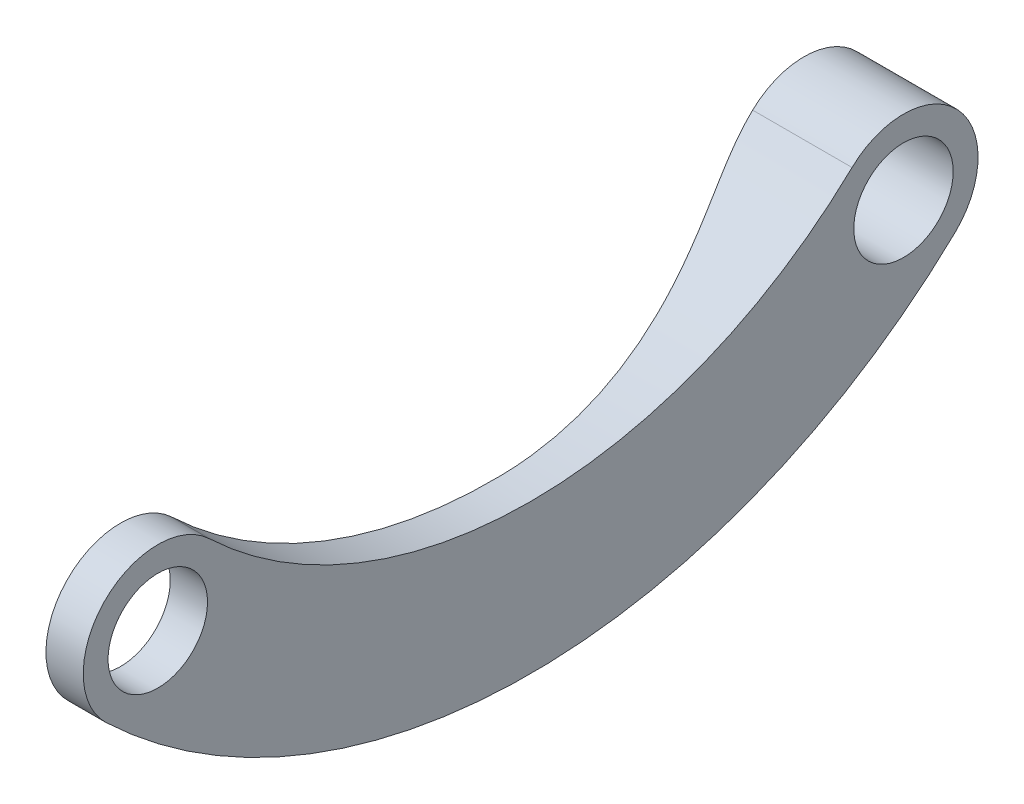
ISO-10303-21;
HEADER;
FILE_DESCRIPTION(('STEP AP214'),'2;1');
FILE_NAME('part.step','',(''),(''),'','','');
FILE_SCHEMA(('AUTOMOTIVE_DESIGN { 1 0 10303 214 1 1 1 1 }'));
ENDSEC;
DATA;
#1=APPLICATION_CONTEXT('core data for automotive mechanical design processes');
#2=APPLICATION_PROTOCOL_DEFINITION('international standard','automotive_design',2000,#1);
#3=PRODUCT_CONTEXT('',#1,'mechanical');
#4=PRODUCT('Part','Part','',(#3));
#5=PRODUCT_RELATED_PRODUCT_CATEGORY('part','',(#4));
#6=PRODUCT_DEFINITION_FORMATION('','',#4);
#7=PRODUCT_DEFINITION_CONTEXT('part definition',#1,'design');
#8=PRODUCT_DEFINITION('design','',#6,#7);
#9=PRODUCT_DEFINITION_SHAPE('','',#8);
#10=(LENGTH_UNIT() NAMED_UNIT(*) SI_UNIT(.MILLI.,.METRE.));
#11=(NAMED_UNIT(*) PLANE_ANGLE_UNIT() SI_UNIT($,.RADIAN.));
#12=(NAMED_UNIT(*) SI_UNIT($,.STERADIAN.) SOLID_ANGLE_UNIT());
#13=UNCERTAINTY_MEASURE_WITH_UNIT(LENGTH_MEASURE(1.E-05),#10,'distance_accuracy_value','');
#14=(GEOMETRIC_REPRESENTATION_CONTEXT(3) GLOBAL_UNCERTAINTY_ASSIGNED_CONTEXT((#13)) GLOBAL_UNIT_ASSIGNED_CONTEXT((#10,
#11,#12)) REPRESENTATION_CONTEXT('',''));
#15=CARTESIAN_POINT('',(0.,0.,0.));
#16=DIRECTION('',(0.,0.,1.));
#17=DIRECTION('',(1.,0.,0.));
#18=AXIS2_PLACEMENT_3D('',#15,#16,#17);
#19=CARTESIAN_POINT('',(20.,0.,150.));
#20=DIRECTION('',(-1.,0.,0.));
#21=DIRECTION('',(0.,0.,1.));
#22=AXIS2_PLACEMENT_3D('',#19,#20,#21);
#23=CYLINDRICAL_SURFACE('',#22,30.);
#24=CARTESIAN_POINT('',(-5.,0.,150.));
#25=DIRECTION('',(1.,0.,0.));
#26=DIRECTION('',(0.,0.,-1.));
#27=AXIS2_PLACEMENT_3D('',#24,#25,#26);
#28=CIRCLE('',#27,30.);
#29=CARTESIAN_POINT('',(-5.,21.7241379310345,129.310344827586));
#30=VERTEX_POINT('',#29);
#31=CARTESIAN_POINT('',(-5.,-21.7241379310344,170.689655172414));
#32=VERTEX_POINT('',#31);
#33=EDGE_CURVE('E91',#30,#32,#28,.T.);
#34=ORIENTED_EDGE('',*,*,#33,.F.);
#35=DIRECTION('',(-1.,0.,0.));
#36=VECTOR('',#35,1.);
#37=CARTESIAN_POINT('',(20.,21.7241379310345,129.310344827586));
#38=LINE('',#37,#36);
#39=CARTESIAN_POINT('',(-20.,21.7241379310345,129.310344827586));
#40=VERTEX_POINT('',#39);
#41=EDGE_CURVE('E246',#30,#40,#38,.T.);
#42=ORIENTED_EDGE('',*,*,#41,.T.);
#43=CARTESIAN_POINT('',(-20.,0.,150.));
#44=DIRECTION('',(1.,0.,0.));
#45=DIRECTION('',(0.,0.,-1.));
#46=AXIS2_PLACEMENT_3D('',#43,#44,#45);
#47=CIRCLE('',#46,30.);
#48=CARTESIAN_POINT('',(-20.,-21.7241379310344,170.689655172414));
#49=VERTEX_POINT('',#48);
#50=EDGE_CURVE('E112',#40,#49,#47,.T.);
#51=ORIENTED_EDGE('',*,*,#50,.T.);
#52=DIRECTION('',(-1.,0.,0.));
#53=VECTOR('',#52,1.);
#54=CARTESIAN_POINT('',(20.,-21.7241379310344,170.689655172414));
#55=LINE('',#54,#53);
#56=EDGE_CURVE('E106',#32,#49,#55,.T.);
#57=ORIENTED_EDGE('',*,*,#56,.F.);
#58=EDGE_LOOP('',(#34,#42,#51,#57));
#59=FACE_BOUND('',#58,.T.);
#60=ADVANCED_FACE('F38',(#59),#23,.T.);
#61=CARTESIAN_POINT('',(20.,157.5,0.));
#62=DIRECTION('',(-1.,0.,0.));
#63=DIRECTION('',(0.,0.,1.));
#64=AXIS2_PLACEMENT_3D('',#61,#62,#63);
#65=CYLINDRICAL_SURFACE('',#64,247.5);
#66=CARTESIAN_POINT('',(-5.,157.5,0.));
#67=DIRECTION('',(1.,0.,0.));
#68=DIRECTION('',(0.,0.,-1.));
#69=AXIS2_PLACEMENT_3D('',#66,#67,#68);
#70=CIRCLE('',#69,247.5);
#71=CARTESIAN_POINT('',(-5.,-21.7241379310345,-170.689655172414));
#72=VERTEX_POINT('',#71);
#73=EDGE_CURVE('E95',#32,#72,#70,.T.);
#74=ORIENTED_EDGE('',*,*,#73,.F.);
#75=ORIENTED_EDGE('',*,*,#56,.T.);
#76=CARTESIAN_POINT('',(-20.,157.5,0.));
#77=DIRECTION('',(1.,0.,0.));
#78=DIRECTION('',(0.,0.,-1.));
#79=AXIS2_PLACEMENT_3D('',#76,#77,#78);
#80=CIRCLE('',#79,247.5);
#81=CARTESIAN_POINT('',(-20.,-88.3093410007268,-28.8793676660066));
#82=VERTEX_POINT('',#81);
#83=EDGE_CURVE('E247',#49,#82,#80,.T.);
#84=ORIENTED_EDGE('',*,*,#83,.T.);
#85=CARTESIAN_POINT('',(-20.,-88.3093410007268,-28.8793676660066));
#86=CARTESIAN_POINT('',(-19.9999995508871,-88.136705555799,-30.3487798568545));
#87=CARTESIAN_POINT('',(-20.0083085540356,-87.9508964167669,-31.8165991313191));
#88=CARTESIAN_POINT('',(-20.0416306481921,-87.5530174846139,-34.7484851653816));
#89=CARTESIAN_POINT('',(-20.066643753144,-87.3409476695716,-36.2125519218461));
#90=CARTESIAN_POINT('',(-20.1668630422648,-86.6655042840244,-40.5980976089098));
#91=CARTESIAN_POINT('',(-20.2672491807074,-86.1628764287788,-43.5130950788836));
#92=CARTESIAN_POINT('',(-20.5355835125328,-85.0542901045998,-49.319372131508));
#93=CARTESIAN_POINT('',(-20.7035145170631,-84.4483579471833,-52.2106575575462));
#94=CARTESIAN_POINT('',(-21.107124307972,-83.134564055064,-57.9652172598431));
#95=CARTESIAN_POINT('',(-21.3428027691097,-82.4267028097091,-60.8284916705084));
#96=CARTESIAN_POINT('',(-21.8787227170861,-80.9194660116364,-66.4897861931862));
#97=CARTESIAN_POINT('',(-22.1782041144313,-80.1212156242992,-69.2881780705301));
#98=CARTESIAN_POINT('',(-22.8427397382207,-78.4289624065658,-74.8479689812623));
#99=CARTESIAN_POINT('',(-23.2077939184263,-77.5349596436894,-77.6093680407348));
#100=CARTESIAN_POINT('',(-24.0024466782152,-75.6536203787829,-83.0905185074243));
#101=CARTESIAN_POINT('',(-24.4320402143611,-74.6662911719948,-85.8102731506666));
#102=CARTESIAN_POINT('',(-25.3541509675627,-72.6008160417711,-91.2041940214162));
#103=CARTESIAN_POINT('',(-25.8466680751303,-71.5226702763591,-93.878360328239));
#104=CARTESIAN_POINT('',(-26.8980458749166,-69.2656428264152,-99.2071509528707));
#105=CARTESIAN_POINT('',(-27.4575876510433,-68.0857683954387,-101.861221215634));
#106=CARTESIAN_POINT('',(-28.3403639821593,-66.2505365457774,-105.80192734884));
#107=CARTESIAN_POINT('',(-28.6418779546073,-65.6278664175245,-107.108807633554));
#108=CARTESIAN_POINT('',(-29.2587480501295,-64.3610354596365,-109.708805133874));
#109=CARTESIAN_POINT('',(-29.5741039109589,-63.7168750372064,-111.00192260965));
#110=CARTESIAN_POINT('',(-30.2179987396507,-62.4071668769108,-113.574522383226));
#111=CARTESIAN_POINT('',(-30.5465420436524,-61.7416121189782,-114.854000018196));
#112=CARTESIAN_POINT('',(-31.2157730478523,-60.3896072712,-117.398657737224));
#113=CARTESIAN_POINT('',(-31.5564607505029,-59.7031571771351,-118.663837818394));
#114=CARTESIAN_POINT('',(-32.24881278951,-58.3096478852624,-121.179675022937));
#115=CARTESIAN_POINT('',(-32.6004766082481,-57.6025896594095,-122.430332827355));
#116=CARTESIAN_POINT('',(-33.3133792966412,-56.1680307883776,-124.917105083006));
#117=CARTESIAN_POINT('',(-33.6746181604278,-55.4405301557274,-126.153219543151));
#118=CARTESIAN_POINT('',(-34.4034155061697,-53.9682418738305,-128.605871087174));
#119=CARTESIAN_POINT('',(-34.7709419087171,-53.2235375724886,-129.822467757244));
#120=CARTESIAN_POINT('',(-35.5115920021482,-51.714001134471,-132.241386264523));
#121=CARTESIAN_POINT('',(-35.8847157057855,-50.9491689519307,-133.443708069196));
#122=CARTESIAN_POINT('',(-36.6339151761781,-49.3991477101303,-135.834541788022));
#123=CARTESIAN_POINT('',(-37.0099914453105,-48.6139551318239,-137.023051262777));
#124=CARTESIAN_POINT('',(-37.7616063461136,-47.0230962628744,-139.386449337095));
#125=CARTESIAN_POINT('',(-38.1371449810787,-46.2174300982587,-140.561338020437));
#126=CARTESIAN_POINT('',(-38.8830381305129,-44.5858480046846,-142.897123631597));
#127=CARTESIAN_POINT('',(-39.2533966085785,-43.7599490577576,-144.058031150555));
#128=CARTESIAN_POINT('',(-39.9837388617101,-42.0865989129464,-146.367596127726));
#129=CARTESIAN_POINT('',(-40.3437222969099,-41.2391470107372,-147.516253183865));
#130=CARTESIAN_POINT('',(-41.0461784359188,-39.5221617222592,-149.801735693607));
#131=CARTESIAN_POINT('',(-41.3886571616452,-38.6526360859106,-150.938565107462));
#132=CARTESIAN_POINT('',(-42.0474544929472,-36.8902605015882,-153.201609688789));
#133=CARTESIAN_POINT('',(-42.3637756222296,-35.9974128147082,-154.327825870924));
#134=CARTESIAN_POINT('',(-42.8339810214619,-34.5687819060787,-156.097815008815));
#135=CARTESIAN_POINT('',(-43.0001390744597,-34.0411024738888,-156.744873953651));
#136=CARTESIAN_POINT('',(-43.3177380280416,-32.9774093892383,-158.03577442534));
#137=CARTESIAN_POINT('',(-43.4691788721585,-32.4413957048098,-158.67961593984));
#138=CARTESIAN_POINT('',(-43.7547709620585,-31.3612683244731,-159.963666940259));
#139=CARTESIAN_POINT('',(-43.8889326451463,-30.8171597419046,-160.603878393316));
#140=CARTESIAN_POINT('',(-44.1375288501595,-29.7205126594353,-161.880937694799));
#141=CARTESIAN_POINT('',(-44.2519632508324,-29.1679741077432,-162.517785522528));
#142=CARTESIAN_POINT('',(-44.4588065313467,-28.0536644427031,-163.788898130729));
#143=CARTESIAN_POINT('',(-44.5511782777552,-27.4918794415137,-164.423156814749));
#144=CARTESIAN_POINT('',(-44.7114028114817,-26.3602596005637,-165.687581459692));
#145=CARTESIAN_POINT('',(-44.7792565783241,-25.790425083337,-166.317747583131));
#146=CARTESIAN_POINT('',(-44.861369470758,-24.9293990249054,-167.260114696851));
#147=CARTESIAN_POINT('',(-44.8854770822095,-24.6410454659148,-167.574077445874));
#148=CARTESIAN_POINT('',(-44.9269320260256,-24.0624933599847,-168.200751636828));
#149=CARTESIAN_POINT('',(-44.9442793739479,-23.7722948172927,-168.513463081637));
#150=CARTESIAN_POINT('',(-44.9720868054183,-23.1900817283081,-169.137596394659));
#151=CARTESIAN_POINT('',(-44.9825457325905,-22.8980668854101,-169.449018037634));
#152=CARTESIAN_POINT('',(-44.9965068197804,-22.3123479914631,-170.070432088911));
#153=CARTESIAN_POINT('',(-45.0000088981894,-22.0186439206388,-170.380424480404));
#154=CARTESIAN_POINT('',(-45.0000000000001,-21.7241379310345,-170.689655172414));
#155=B_SPLINE_CURVE_WITH_KNOTS('',3,(#85,#86,#87,#88,#89,#90,#91,#92,#93,#94,#95,#96,#97,#98,
#99,#100,#101,#102,#103,#104,#105,#106,#107,#108,#109,#110,#111,#112,#113,#114,#115,#116,#117,
#118,#119,#120,#121,#122,#123,#124,#125,#126,#127,#128,#129,#130,#131,#132,#133,#134,#135,#136,
#137,#138,#139,#140,#141,#142,#143,#144,#145,#146,#147,#148,#149,#150,#151,#152,#153,#154),
.UNSPECIFIED.,.F.,.F.,(4,2,2,2,2,2,2,2,2,2,2,2,2,2,2,2,2,2,2,2,2,2,2,2,2,2,2,2,2,2,2,2,2,2,4),
(0.,4.43838264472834,8.87676899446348,17.7530191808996,26.6270119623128,35.5009621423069,
44.2745816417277,53.048194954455,61.8211230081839,70.594035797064,79.4651762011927,
83.9010552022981,88.3368501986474,92.7741158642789,97.2113824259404,101.648440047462,
106.085494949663,110.504311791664,114.923138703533,119.342734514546,123.76230312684,
128.178281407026,132.594404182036,137.008997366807,141.423164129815,143.97697014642,
146.530785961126,149.083051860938,151.635333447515,154.19188095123,156.748326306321,
158.02918067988,159.310032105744,160.591098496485,161.872179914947),.UNSPECIFIED.);
#156=CARTESIAN_POINT('',(-45.,-21.7241379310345,-170.689655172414));
#157=VERTEX_POINT('',#156);
#158=EDGE_CURVE('E52',#82,#157,#155,.T.);
#159=ORIENTED_EDGE('',*,*,#158,.T.);
#160=DIRECTION('',(-1.,0.,0.));
#161=VECTOR('',#160,1.);
#162=CARTESIAN_POINT('',(20.,-21.7241379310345,-170.689655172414));
#163=LINE('',#162,#161);
#164=EDGE_CURVE('E59',#72,#157,#163,.T.);
#165=ORIENTED_EDGE('',*,*,#164,.F.);
#166=EDGE_LOOP('',(#74,#75,#84,#159,#165));
#167=FACE_BOUND('',#166,.T.);
#168=ADVANCED_FACE('F104',(#167),#65,.T.);
#169=CARTESIAN_POINT('',(20.,0.,-150.));
#170=DIRECTION('',(-1.,0.,0.));
#171=DIRECTION('',(0.,0.,1.));
#172=AXIS2_PLACEMENT_3D('',#169,#170,#171);
#173=CYLINDRICAL_SURFACE('',#172,30.);
#174=ORIENTED_EDGE('',*,*,#164,.T.);
#175=CARTESIAN_POINT('',(-45.,0.,-150.));
#176=DIRECTION('',(1.,0.,0.));
#177=DIRECTION('',(0.,0.,-1.));
#178=AXIS2_PLACEMENT_3D('',#175,#176,#177);
#179=CIRCLE('',#178,29.9999999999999);
#180=CARTESIAN_POINT('',(-45.,21.7241379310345,-129.310344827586));
#181=VERTEX_POINT('',#180);
#182=EDGE_CURVE('E264',#157,#181,#179,.T.);
#183=ORIENTED_EDGE('',*,*,#182,.T.);
#184=DIRECTION('',(-1.,0.,0.));
#185=VECTOR('',#184,1.);
#186=CARTESIAN_POINT('',(20.,21.7241379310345,-129.310344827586));
#187=LINE('',#186,#185);
#188=CARTESIAN_POINT('',(-5.,21.7241379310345,-129.310344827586));
#189=VERTEX_POINT('',#188);
#190=EDGE_CURVE('E66',#189,#181,#187,.T.);
#191=ORIENTED_EDGE('',*,*,#190,.F.);
#192=CARTESIAN_POINT('',(-5.,0.,-150.));
#193=DIRECTION('',(1.,0.,0.));
#194=DIRECTION('',(0.,0.,-1.));
#195=AXIS2_PLACEMENT_3D('',#192,#193,#194);
#196=CIRCLE('',#195,30.);
#197=EDGE_CURVE('E108',#72,#189,#196,.T.);
#198=ORIENTED_EDGE('',*,*,#197,.F.);
#199=EDGE_LOOP('',(#174,#183,#191,#198));
#200=FACE_BOUND('',#199,.T.);
#201=ADVANCED_FACE('F127',(#200),#173,.T.);
#202=CARTESIAN_POINT('',(20.,157.5,0.));
#203=DIRECTION('',(-1.,0.,0.));
#204=DIRECTION('',(0.,0.,1.));
#205=AXIS2_PLACEMENT_3D('',#202,#203,#204);
#206=CYLINDRICAL_SURFACE('',#205,187.5);
#207=CARTESIAN_POINT('',(-5.,157.5,0.));
#208=DIRECTION('',(-1.,0.,0.));
#209=DIRECTION('',(0.,0.,-1.));
#210=AXIS2_PLACEMENT_3D('',#207,#208,#209);
#211=CIRCLE('',#210,187.5);
#212=EDGE_CURVE('E96',#189,#30,#211,.T.);
#213=ORIENTED_EDGE('',*,*,#212,.F.);
#214=ORIENTED_EDGE('',*,*,#190,.T.);
#215=CARTESIAN_POINT('',(-45.,21.7241379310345,-129.310344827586));
#216=CARTESIAN_POINT('',(-45.000025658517,21.3932432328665,-128.962907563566));
#217=CARTESIAN_POINT('',(-44.9941794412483,21.0636878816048,-128.61420197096));
#218=CARTESIAN_POINT('',(-44.9709315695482,20.4074669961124,-127.914492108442));
#219=CARTESIAN_POINT('',(-44.9535304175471,20.0808013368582,-127.563487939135));
#220=CARTESIAN_POINT('',(-44.907373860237,19.4307238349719,-126.859585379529));
#221=CARTESIAN_POINT('',(-44.8786248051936,19.1073102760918,-126.506688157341));
#222=CARTESIAN_POINT('',(-44.8101377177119,18.4637247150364,-125.799018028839));
#223=CARTESIAN_POINT('',(-44.7703995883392,18.143552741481,-125.444245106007));
#224=CARTESIAN_POINT('',(-44.6357844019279,17.191043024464,-124.38066385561));
#225=CARTESIAN_POINT('',(-44.5252837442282,16.5636884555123,-123.669318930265));
#226=CARTESIAN_POINT('',(-44.2671609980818,15.3230933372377,-122.241042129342));
#227=CARTESIAN_POINT('',(-44.119533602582,14.7098548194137,-121.524109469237));
#228=CARTESIAN_POINT('',(-43.7926869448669,13.4981000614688,-120.085747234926));
#229=CARTESIAN_POINT('',(-43.6134841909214,12.8995763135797,-119.364320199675));
#230=CARTESIAN_POINT('',(-43.2289285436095,11.7168114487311,-117.916858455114));
#231=CARTESIAN_POINT('',(-43.0235765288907,11.1325698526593,-117.1908239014));
#232=CARTESIAN_POINT('',(-42.5915345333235,9.9770790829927,-115.732900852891));
#233=CARTESIAN_POINT('',(-42.3648123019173,9.40585121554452,-115.001005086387));
#234=CARTESIAN_POINT('',(-42.012375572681,8.55909669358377,-113.89939331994));
#235=CARTESIAN_POINT('',(-41.8928355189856,8.2785214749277,-113.53155477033));
#236=CARTESIAN_POINT('',(-41.6501443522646,7.72066509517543,-112.794567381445));
#237=CARTESIAN_POINT('',(-41.5269932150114,7.44338395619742,-112.425418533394));
#238=CARTESIAN_POINT('',(-41.2249994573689,6.77586889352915,-111.529889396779));
#239=CARTESIAN_POINT('',(-41.0445612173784,6.38728533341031,-111.002816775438));
#240=CARTESIAN_POINT('',(-40.6786127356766,5.61648118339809,-109.945780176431));
#241=CARTESIAN_POINT('',(-40.4931024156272,5.23426069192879,-109.415816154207));
#242=CARTESIAN_POINT('',(-40.1181037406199,4.47601214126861,-108.352828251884));
#243=CARTESIAN_POINT('',(-39.9286151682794,4.09998442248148,-107.819804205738));
#244=CARTESIAN_POINT('',(-39.5466351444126,3.35400673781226,-106.7505862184));
#245=CARTESIAN_POINT('',(-39.3541436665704,2.98405682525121,-106.214392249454));
#246=CARTESIAN_POINT('',(-38.77338788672,1.88297519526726,-104.600613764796));
#247=CARTESIAN_POINT('',(-38.3819258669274,1.16077897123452,-103.518067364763));
#248=CARTESIAN_POINT('',(-37.5961798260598,-0.260449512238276,-101.338948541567));
#249=CARTESIAN_POINT('',(-37.2018958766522,-0.959482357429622,-100.242376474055));
#250=CARTESIAN_POINT('',(-36.4148100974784,-2.3348851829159,-98.0344390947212));
#251=CARTESIAN_POINT('',(-36.0220083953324,-3.01125324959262,-96.9230725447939));
#252=CARTESIAN_POINT('',(-35.2413334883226,-4.34145088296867,-94.6852105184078));
#253=CARTESIAN_POINT('',(-34.8534603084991,-4.99528033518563,-93.5587149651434));
#254=CARTESIAN_POINT('',(-34.0853746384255,-6.28032322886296,-91.2904952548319));
#255=CARTESIAN_POINT('',(-33.705161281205,-6.91153923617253,-90.148772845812));
#256=CARTESIAN_POINT('',(-32.9544884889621,-8.15128833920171,-87.8499065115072));
#257=CARTESIAN_POINT('',(-32.5840290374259,-8.7598214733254,-86.6927626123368));
#258=CARTESIAN_POINT('',(-31.8538988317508,-9.95506944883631,-84.3609470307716));
#259=CARTESIAN_POINT('',(-31.4942495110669,-10.5417414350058,-83.1862466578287));
#260=CARTESIAN_POINT('',(-30.7878604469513,-11.6917348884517,-80.8216264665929));
#261=CARTESIAN_POINT('',(-30.4411207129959,-12.2550563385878,-79.6317066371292));
#262=CARTESIAN_POINT('',(-29.7616737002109,-13.3579860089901,-77.2368860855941));
#263=CARTESIAN_POINT('',(-29.428967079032,-13.8975931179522,-76.0319846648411));
#264=CARTESIAN_POINT('',(-28.7785370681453,-14.9526383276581,-73.6076435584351));
#265=CARTESIAN_POINT('',(-28.4608136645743,-15.4680764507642,-72.3882038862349));
#266=CARTESIAN_POINT('',(-27.8411584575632,-16.4742691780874,-69.9354020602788));
#267=CARTESIAN_POINT('',(-27.5392244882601,-16.9650271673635,-68.7020418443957));
#268=CARTESIAN_POINT('',(-26.9517263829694,-17.9214767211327,-66.2217677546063));
#269=CARTESIAN_POINT('',(-26.6661627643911,-18.3871674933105,-64.974853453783));
#270=CARTESIAN_POINT('',(-25.8348792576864,-19.745868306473,-61.2148151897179));
#271=CARTESIAN_POINT('',(-25.314478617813,-20.6006496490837,-58.6820480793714));
#272=CARTESIAN_POINT('',(-24.429925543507,-22.0630603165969,-54.0206265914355));
#273=CARTESIAN_POINT('',(-24.0543997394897,-22.6876979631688,-51.8994185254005));
#274=CARTESIAN_POINT('',(-23.3524387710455,-23.8633482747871,-47.6286728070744));
#275=CARTESIAN_POINT('',(-23.0260020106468,-24.4143633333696,-45.4791360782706));
#276=CARTESIAN_POINT('',(-22.4229957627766,-25.4409902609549,-41.1555622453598));
#277=CARTESIAN_POINT('',(-22.1464187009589,-25.9166135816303,-38.9815289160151));
#278=CARTESIAN_POINT('',(-21.6434512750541,-26.791082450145,-34.6122906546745));
#279=CARTESIAN_POINT('',(-21.4170613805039,-27.1899272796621,-32.4170855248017));
#280=CARTESIAN_POINT('',(-21.0120431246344,-27.9141188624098,-27.9815553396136));
#281=CARTESIAN_POINT('',(-20.8340525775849,-28.2384760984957,-25.7410102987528));
#282=CARTESIAN_POINT('',(-20.5295045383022,-28.806146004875,-21.2462131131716));
#283=CARTESIAN_POINT('',(-20.4029472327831,-29.0494583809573,-18.9919609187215));
#284=CARTESIAN_POINT('',(-20.2008662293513,-29.4543665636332,-14.4728377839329));
#285=CARTESIAN_POINT('',(-20.1253635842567,-29.6159286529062,-12.2079628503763));
#286=CARTESIAN_POINT('',(-20.0500381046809,-29.7965079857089,-8.8066819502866));
#287=CARTESIAN_POINT('',(-20.0312510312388,-29.846407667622,-7.67222808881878));
#288=CARTESIAN_POINT('',(-20.0062318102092,-29.9255929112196,-5.40246434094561));
#289=CARTESIAN_POINT('',(-19.999999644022,-29.9548785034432,-4.26715445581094));
#290=CARTESIAN_POINT('',(-20.,-29.9738457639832,-3.13163766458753));
#291=B_SPLINE_CURVE_WITH_KNOTS('',3,(#215,#216,#217,#218,#219,#220,#221,#222,#223,#224,#225,
#226,#227,#228,#229,#230,#231,#232,#233,#234,#235,#236,#237,#238,#239,#240,#241,#242,#243,#244,
#245,#246,#247,#248,#249,#250,#251,#252,#253,#254,#255,#256,#257,#258,#259,#260,#261,#262,#263,
#264,#265,#266,#267,#268,#269,#270,#271,#272,#273,#274,#275,#276,#277,#278,#279,#280,#281,#282,
#283,#284,#285,#286,#287,#288,#289,#290),.UNSPECIFIED.,.F.,.F.,(4,2,2,2,2,2,2,2,2,2,2,2,2,2,2,2,
2,2,2,2,2,2,2,2,2,2,2,2,2,2,2,2,2,2,2,2,2,4),(0.,1.43933927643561,2.8786159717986,
4.31708838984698,5.75557349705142,8.61917176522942,11.4831796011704,14.3456944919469,
17.2081132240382,20.0749230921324,21.5083792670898,22.9418450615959,24.9794878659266,
27.0171621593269,29.0549480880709,31.0927518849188,35.1692597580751,39.2456644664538,
43.3224124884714,47.3991812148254,51.4754858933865,55.5517836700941,59.6356917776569,
63.7196028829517,67.8037051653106,71.8878036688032,75.9713404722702,80.055006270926,
88.221180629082,94.9481813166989,101.674963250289,108.400722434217,115.126544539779,
121.937121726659,128.747723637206,135.561132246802,138.968029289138,142.374921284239),.UNSPECIFIED.);
#292=CARTESIAN_POINT('',(-20.,-29.9738457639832,-3.13163766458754));
#293=VERTEX_POINT('',#292);
#294=EDGE_CURVE('E11',#181,#293,#291,.T.);
#295=ORIENTED_EDGE('',*,*,#294,.T.);
#296=CARTESIAN_POINT('',(-20.,157.5,0.));
#297=DIRECTION('',(-1.,0.,0.));
#298=DIRECTION('',(0.,0.,-1.));
#299=AXIS2_PLACEMENT_3D('',#296,#297,#298);
#300=CIRCLE('',#299,187.5);
#301=EDGE_CURVE('E244',#293,#40,#300,.T.);
#302=ORIENTED_EDGE('',*,*,#301,.T.);
#303=ORIENTED_EDGE('',*,*,#41,.F.);
#304=EDGE_LOOP('',(#213,#214,#295,#302,#303));
#305=FACE_BOUND('',#304,.T.);
#306=ADVANCED_FACE('F143',(#305),#206,.F.);
#307=CARTESIAN_POINT('',(20.,0.,150.));
#308=DIRECTION('',(-1.,0.,0.));
#309=DIRECTION('',(0.,0.,1.));
#310=AXIS2_PLACEMENT_3D('',#307,#308,#309);
#311=CYLINDRICAL_SURFACE('',#310,20.0000000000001);
#312=CARTESIAN_POINT('',(-20.,0.,150.));
#313=DIRECTION('',(1.,0.,0.));
#314=DIRECTION('',(0.,0.,-1.));
#315=AXIS2_PLACEMENT_3D('',#312,#313,#314);
#316=CIRCLE('',#315,20.0000000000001);
#317=CARTESIAN_POINT('',(-20.,0.,130.));
#318=VERTEX_POINT('',#317);
#319=EDGE_CURVE('E253',#318,#318,#316,.T.);
#320=ORIENTED_EDGE('',*,*,#319,.F.);
#321=EDGE_LOOP('',(#320));
#322=FACE_BOUND('',#321,.T.);
#323=CARTESIAN_POINT('',(-5.,0.,150.));
#324=DIRECTION('',(1.,0.,0.));
#325=DIRECTION('',(0.,0.,-1.));
#326=AXIS2_PLACEMENT_3D('',#323,#324,#325);
#327=CIRCLE('',#326,20.0000000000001);
#328=CARTESIAN_POINT('',(-5.,0.,130.));
#329=VERTEX_POINT('',#328);
#330=EDGE_CURVE('E101',#329,#329,#327,.T.);
#331=ORIENTED_EDGE('',*,*,#330,.T.);
#332=EDGE_LOOP('',(#331));
#333=FACE_BOUND('',#332,.T.);
#334=ADVANCED_FACE('F149',(#322,#333),#311,.F.);
#335=CARTESIAN_POINT('',(20.,0.,-150.));
#336=DIRECTION('',(-1.,0.,0.));
#337=DIRECTION('',(0.,0.,1.));
#338=AXIS2_PLACEMENT_3D('',#335,#336,#337);
#339=CYLINDRICAL_SURFACE('',#338,20.);
#340=CARTESIAN_POINT('',(-5.,0.,-150.));
#341=DIRECTION('',(1.,0.,0.));
#342=DIRECTION('',(0.,0.,-1.));
#343=AXIS2_PLACEMENT_3D('',#340,#341,#342);
#344=CIRCLE('',#343,20.);
#345=CARTESIAN_POINT('',(-5.,0.,-170.));
#346=VERTEX_POINT('',#345);
#347=EDGE_CURVE('E260',#346,#346,#344,.T.);
#348=ORIENTED_EDGE('',*,*,#347,.T.);
#349=EDGE_LOOP('',(#348));
#350=FACE_BOUND('',#349,.T.);
#351=CARTESIAN_POINT('',(-45.,0.,-150.));
#352=DIRECTION('',(1.,0.,0.));
#353=DIRECTION('',(0.,0.,-1.));
#354=AXIS2_PLACEMENT_3D('',#351,#352,#353);
#355=CIRCLE('',#354,20.);
#356=CARTESIAN_POINT('',(-45.,0.,-170.));
#357=VERTEX_POINT('',#356);
#358=EDGE_CURVE('E265',#357,#357,#355,.T.);
#359=ORIENTED_EDGE('',*,*,#358,.F.);
#360=EDGE_LOOP('',(#359));
#361=FACE_BOUND('',#360,.T.);
#362=ADVANCED_FACE('F155',(#350,#361),#339,.F.);
#363=CARTESIAN_POINT('',(-20.,78.75,75.0000000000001));
#364=DIRECTION('',(1.,0.,0.));
#365=DIRECTION('',(0.,0.,-1.));
#366=AXIS2_PLACEMENT_3D('',#363,#364,#365);
#367=PLANE('',#366);
#368=ORIENTED_EDGE('',*,*,#301,.F.);
#369=CARTESIAN_POINT('',(-20.,0.,-150.));
#370=DIRECTION('',(1.,0.,0.));
#371=DIRECTION('',(0.,0.,-1.));
#372=AXIS2_PLACEMENT_3D('',#369,#370,#371);
#373=CIRCLE('',#372,149.895788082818);
#374=EDGE_CURVE('E113',#293,#82,#373,.T.);
#375=ORIENTED_EDGE('',*,*,#374,.T.);
#376=ORIENTED_EDGE('',*,*,#83,.F.);
#377=ORIENTED_EDGE('',*,*,#50,.F.);
#378=EDGE_LOOP('',(#368,#375,#376,#377));
#379=FACE_BOUND('',#378,.T.);
#380=ORIENTED_EDGE('',*,*,#319,.T.);
#381=EDGE_LOOP('',(#380));
#382=FACE_BOUND('',#381,.T.);
#383=ADVANCED_FACE('F163',(#379,#382),#367,.F.);
#384=CARTESIAN_POINT('',(-5.,78.75,75.0000000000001));
#385=DIRECTION('',(1.,0.,0.));
#386=DIRECTION('',(0.,0.,-1.));
#387=AXIS2_PLACEMENT_3D('',#384,#385,#386);
#388=PLANE('',#387);
#389=ORIENTED_EDGE('',*,*,#73,.T.);
#390=ORIENTED_EDGE('',*,*,#197,.T.);
#391=ORIENTED_EDGE('',*,*,#212,.T.);
#392=ORIENTED_EDGE('',*,*,#33,.T.);
#393=EDGE_LOOP('',(#389,#390,#391,#392));
#394=FACE_BOUND('',#393,.T.);
#395=ORIENTED_EDGE('',*,*,#330,.F.);
#396=EDGE_LOOP('',(#395));
#397=FACE_BOUND('',#396,.T.);
#398=ORIENTED_EDGE('',*,*,#347,.F.);
#399=EDGE_LOOP('',(#398));
#400=FACE_BOUND('',#399,.T.);
#401=ADVANCED_FACE('F93',(#394,#397,#400),#388,.T.);
#402=CARTESIAN_POINT('',(-45.,0.,-150.));
#403=DIRECTION('',(1.,0.,0.));
#404=DIRECTION('',(0.,0.,-1.));
#405=AXIS2_PLACEMENT_3D('',#402,#403,#404);
#406=PLANE('',#405);
#407=ORIENTED_EDGE('',*,*,#358,.T.);
#408=EDGE_LOOP('',(#407));
#409=FACE_BOUND('',#408,.T.);
#410=EDGE_CURVE('E242',#181,#157,#179,.T.);
#411=ORIENTED_EDGE('',*,*,#410,.F.);
#412=ORIENTED_EDGE('',*,*,#182,.F.);
#413=EDGE_LOOP('',(#411,#412));
#414=FACE_BOUND('',#413,.T.);
#415=ADVANCED_FACE('F177',(#409,#414),#406,.F.);
#416=CARTESIAN_POINT('',(-320.,0.,-150.));
#417=DIRECTION('',(1.,0.,0.));
#418=DIRECTION('',(0.,0.,-1.));
#419=AXIS2_PLACEMENT_3D('',#416,#417,#418);
#420=DEGENERATE_TOROIDAL_SURFACE('',#419,149.895788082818,300.,.T.);
#421=ORIENTED_EDGE('',*,*,#294,.F.);
#422=ORIENTED_EDGE('',*,*,#410,.T.);
#423=ORIENTED_EDGE('',*,*,#158,.F.);
#424=ORIENTED_EDGE('',*,*,#374,.F.);
#425=EDGE_LOOP('',(#421,#422,#423,#424));
#426=FACE_BOUND('',#425,.T.);
#427=ADVANCED_FACE('F40',(#426),#420,.F.);
#428=CLOSED_SHELL('',(#60,#168,#201,#306,#334,#362,#383,#401,#415,#427));
#429=MANIFOLD_SOLID_BREP('B2',#428);
#430=ADVANCED_BREP_SHAPE_REPRESENTATION('',(#18,#429),#14);
#431=SHAPE_DEFINITION_REPRESENTATION(#9,#430);
ENDSEC;
END-ISO-10303-21;
